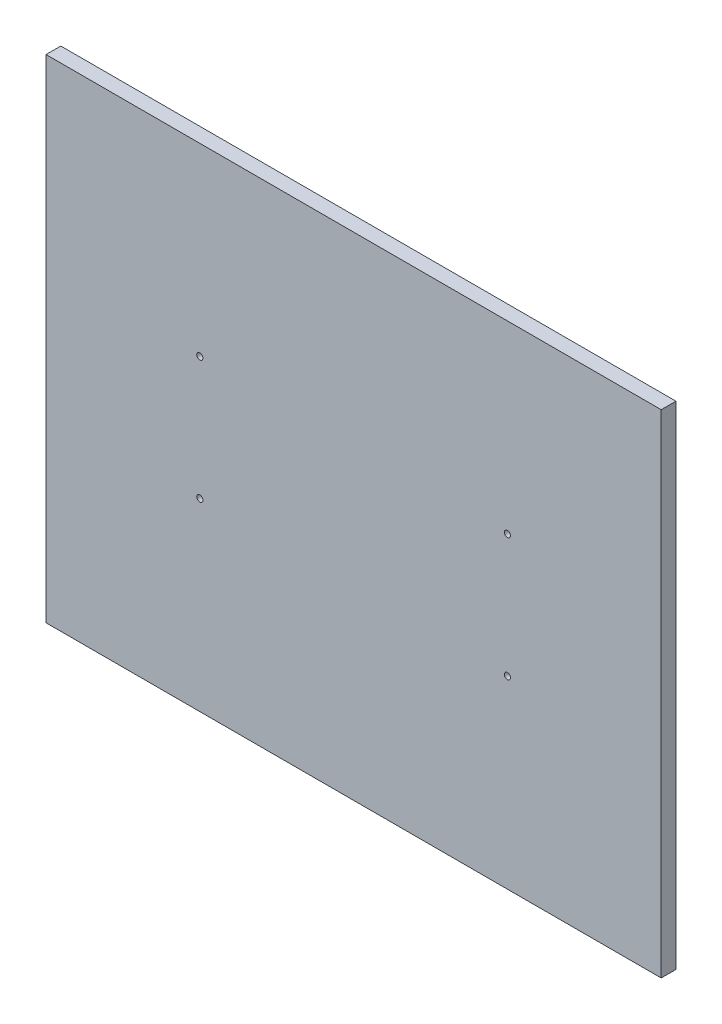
from build123d import *

# Parameters (mm, degrees)
ESQUISSE2_W               = 250
ESQUISSE2_H               = 200
BOSS_EXTRU_2_DEPTH        = 6
ESQUISSE3_R               = 1.25
ENL_V_MAT_EXTRU_1_DEPTH   = 6
SYM_TRIE3_COPY_1_SKETCH_R = 1.25
SYM_TRIE3_COPY_1_DEPTH    = 6


with BuildPart() as part:
    # Esquisse2 → Boss.-Extru.2 (new body)
    with BuildSketch(Plane.XY):
        Rectangle(ESQUISSE2_W, ESQUISSE2_H)
    extrude(amount=BOSS_EXTRU_2_DEPTH)

    # Esquisse3 → Enl_v. mat.-Extru.1 (cut)
    with BuildSketch(Plane(origin=(0, 0, 0), x_dir=(-1, 0, 0), z_dir=(0, 0, -1))):
        with Locations((62.5, 25)):
            Circle(ESQUISSE3_R)
    enl_v_mat_extru_1 = extrude(amount=-ENL_V_MAT_EXTRU_1_DEPTH, mode=Mode.SUBTRACT)

    # Sym_trie2: Enl_v. mat.-Extru.1 across plane
    add(enl_v_mat_extru_1.mirror(Plane.ZX), mode=Mode.SUBTRACT)

    # Sym_trie3: Enl_v. mat.-Extru.1 across plane
    add(enl_v_mat_extru_1.mirror(Plane(origin=(0, 0, 0), x_dir=(0, 0, 1), z_dir=(1, 0, 0))), mode=Mode.SUBTRACT)

    # Sym_trie3 copy 1 sketch → Sym_trie3 copy 1 (cut)
    with BuildSketch(Plane(origin=(0, 0, 0), x_dir=(1, 0, 0), z_dir=(0, 0, -1))):
        with Locations((62.5, 25)):
            Circle(SYM_TRIE3_COPY_1_SKETCH_R)
    extrude(amount=-SYM_TRIE3_COPY_1_DEPTH, mode=Mode.SUBTRACT)


solid = part.part
